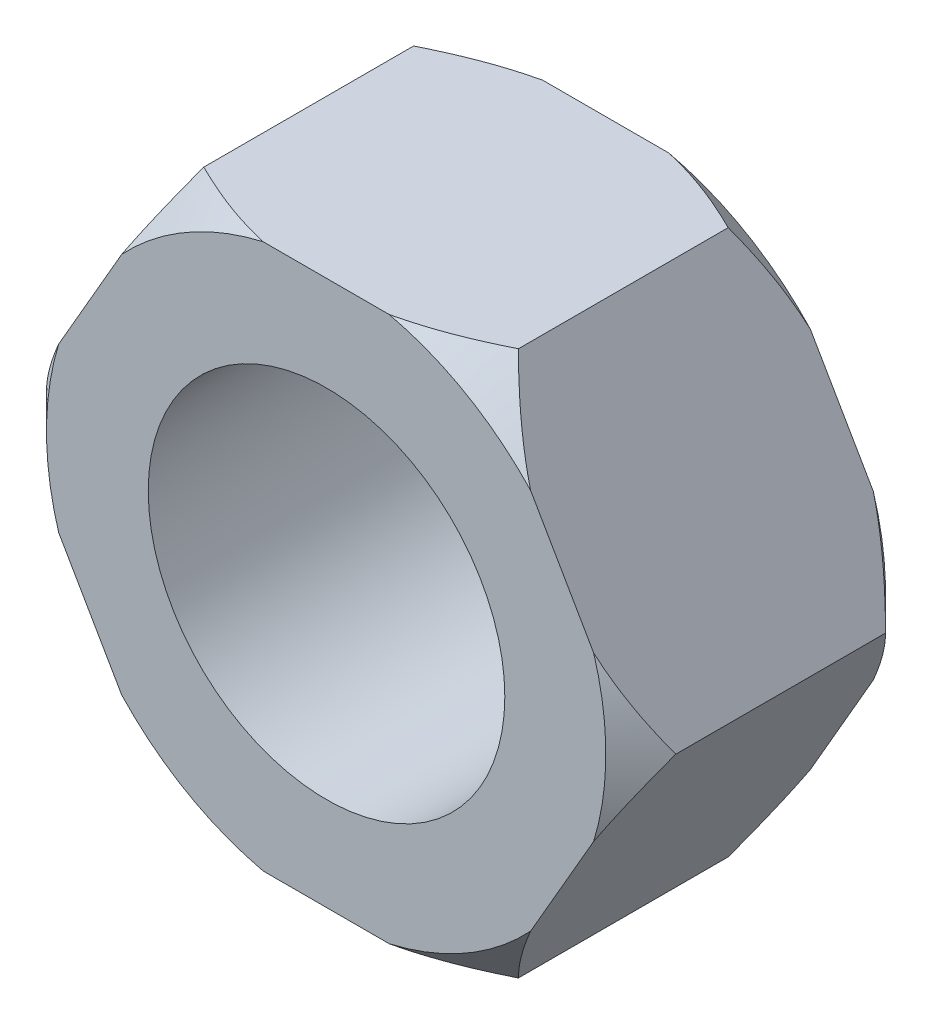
from build123d import *

# Parameters (mm, degrees)
ESQUISSE1_R             = 9
EXTRUSION1_DEPTH        = 8
TROU_TARAUD_M121_D      = 10.2
CHANFREIN1_SIZE         = 1
ESQUISSE4_OUTSIDE_W     = 25.336
ESQUISSE4_OUTSIDE_H     = 25.336
ENL_V_MAT_EXTRU_1_DEPTH = 10


with BuildPart() as part:
    # Esquisse1 → Extrusion1 (new body)
    with BuildSketch(Plane.XY):
        Circle(ESQUISSE1_R)
    extrude(amount=EXTRUSION1_DEPTH)

    # Trou taraud_ M121 (through all)
    with Locations(Plane.XY.offset(8)):
        with Locations((0.010473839, -0.020947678)):
            Hole(TROU_TARAUD_M121_D / 2)

    # Chanfrein1
    chanfrein1_edges = [part.edges().sort_by_distance(p)[0] for p in [
        (-9, 0, 0),
        (-9, 0, 8),
    ]]
    chamfer(chanfrein1_edges, length=CHANFREIN1_SIZE)

    # Esquisse4 outside → Enl_v. mat.-Extru.1 (cut)
    with BuildSketch(Plane.XY.offset(8)):
        Rectangle(ESQUISSE4_OUTSIDE_W, ESQUISSE4_OUTSIDE_H)
        Polygon((9, 0), (4.5, 7.794228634), (-4.5, 7.794228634), (-9, 0), (-4.5, -7.794228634), (4.5, -7.794228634), align=None, mode=Mode.SUBTRACT)
    extrude(amount=-ENL_V_MAT_EXTRU_1_DEPTH, mode=Mode.SUBTRACT)


solid = part.part
